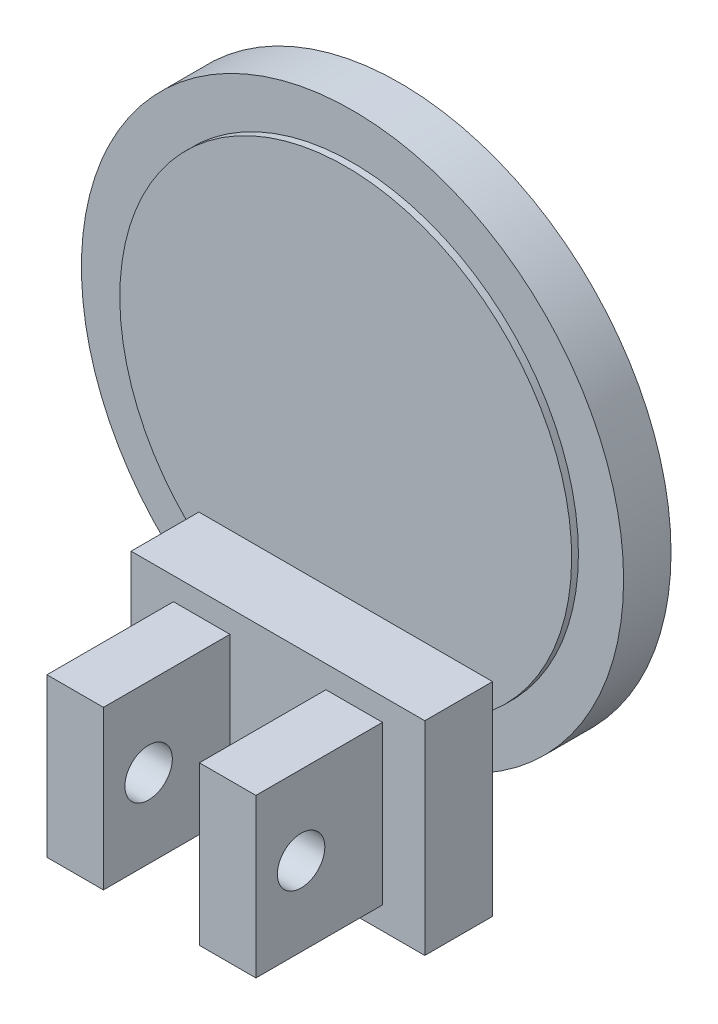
from build123d import *

# Parameters (mm, degrees)
SKETCH_1_R             = 24
F_01_DISC_D48_DEPTH    = 4.2
SKETCH_2_R             = 20
F_02_BOSS_D42_DEPTH    = 0.6
SKETCH_3_W             = 26
SKETCH_3_H             = 6
F_03_CRADLE_BASE_DEPTH = 9
SKETCH_4_W             = 5
SKETCH_4_H             = 11.2
F_04_EAR_R_DEPTH       = 7
SKETCH_5_W             = 5
SKETCH_5_H             = 11.2
F_04_EAR_L_DEPTH       = 7
SKETCH_6_R             = 2.1
F_05_PIN_HOLE_R_DEPTH  = 45.955533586
SKETCH_7_R             = 2.1
F_05_PIN_HOLE_L_DEPTH  = 45.955533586


with BuildPart() as part:
    # Sketch 1 → 01_DISC_D48 (new body)
    with BuildSketch(Plane.XY):
        Circle(SKETCH_1_R)
    extrude(amount=F_01_DISC_D48_DEPTH)

    # Sketch 2 → 02_BOSS_D42 (add)
    with BuildSketch(Plane.XY.offset(4.2)):
        Circle(SKETCH_2_R)
    extrude(amount=F_02_BOSS_D42_DEPTH)

    # Sketch 3 → 03_CRADLE_BASE (add, symmetric)
    with BuildSketch(Plane(origin=(0, -22, 0), x_dir=(1, 0, 0), z_dir=(0, 1, 0))):
        with Locations((0, -7.8)):
            Rectangle(SKETCH_3_W, SKETCH_3_H)
    extrude(amount=F_03_CRADLE_BASE_DEPTH, both=True)

    # Sketch 4 → 04_EAR_R (add, symmetric)
    with BuildSketch(Plane(origin=(0, -22, 0), x_dir=(1, 0, 0), z_dir=(0, 1, 0))):
        with Locations((6.75, -16.4)):
            Rectangle(SKETCH_4_W, SKETCH_4_H)
    extrude(amount=F_04_EAR_R_DEPTH, both=True)

    # Sketch 5 → 04_EAR_L (add, symmetric)
    with BuildSketch(Plane(origin=(0, -22, 0), x_dir=(1, 0, 0), z_dir=(0, 1, 0))):
        with Locations((-6.75, -16.4)):
            Rectangle(SKETCH_5_W, SKETCH_5_H)
    extrude(amount=F_04_EAR_L_DEPTH, both=True)

    # Sketch 6 → 05_PIN_HOLE_R (cut, through all)
    with BuildSketch(Plane(origin=(0, 0, 0), x_dir=(0, 0, -1), z_dir=(1, 0, 0))):
        with Locations(Location((-18, -22, 0), (0, 0, 180))):
            Circle(SKETCH_6_R)
    extrude(amount=F_05_PIN_HOLE_R_DEPTH, mode=Mode.SUBTRACT)

    # Sketch 7 → 05_PIN_HOLE_L (cut, through all)
    with BuildSketch(Plane(origin=(0, 0, 0), x_dir=(0, 0, -1), z_dir=(1, 0, 0))):
        with Locations(Location((-18, -22, 0), (0, 0, 180))):
            Circle(SKETCH_7_R)
    extrude(amount=-F_05_PIN_HOLE_L_DEPTH, mode=Mode.SUBTRACT)


solid = part.part
